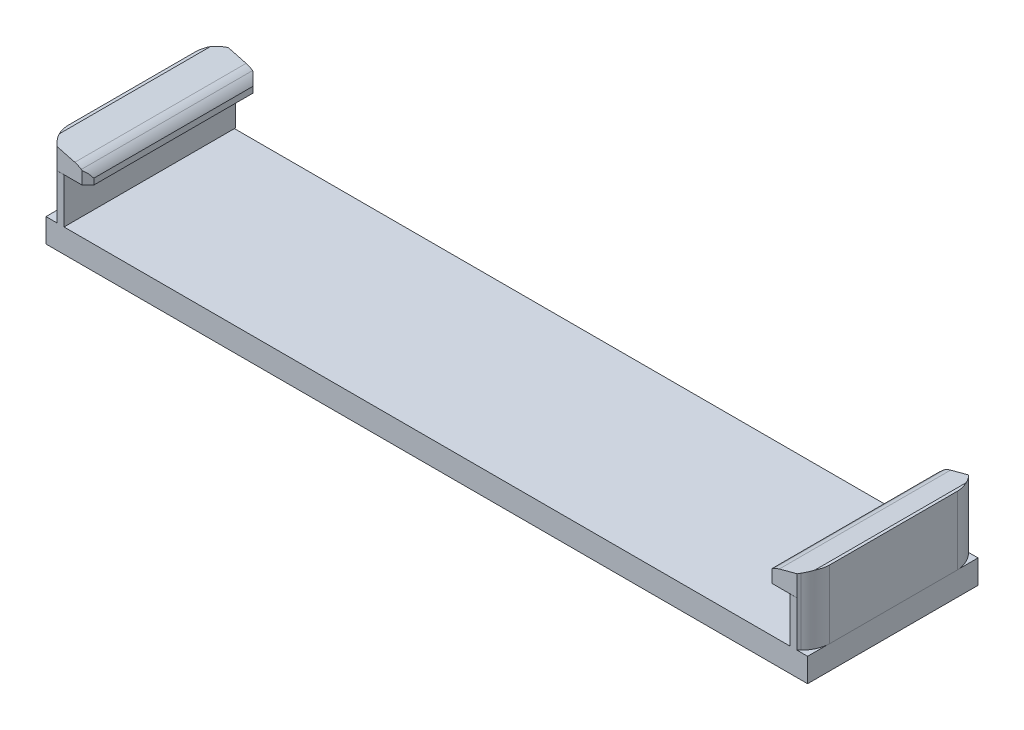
ISO-10303-21;
HEADER;
FILE_DESCRIPTION(('STEP AP214'),'2;1');
FILE_NAME('part.step','',(''),(''),'','','');
FILE_SCHEMA(('AUTOMOTIVE_DESIGN { 1 0 10303 214 1 1 1 1 }'));
ENDSEC;
DATA;
#1=APPLICATION_CONTEXT('core data for automotive mechanical design processes');
#2=APPLICATION_PROTOCOL_DEFINITION('international standard','automotive_design',2000,#1);
#3=PRODUCT_CONTEXT('',#1,'mechanical');
#4=PRODUCT('Part','Part','',(#3));
#5=PRODUCT_RELATED_PRODUCT_CATEGORY('part','',(#4));
#6=PRODUCT_DEFINITION_FORMATION('','',#4);
#7=PRODUCT_DEFINITION_CONTEXT('part definition',#1,'design');
#8=PRODUCT_DEFINITION('design','',#6,#7);
#9=PRODUCT_DEFINITION_SHAPE('','',#8);
#10=(LENGTH_UNIT() NAMED_UNIT(*) SI_UNIT(.MILLI.,.METRE.));
#11=(NAMED_UNIT(*) PLANE_ANGLE_UNIT() SI_UNIT($,.RADIAN.));
#12=(NAMED_UNIT(*) SI_UNIT($,.STERADIAN.) SOLID_ANGLE_UNIT());
#13=UNCERTAINTY_MEASURE_WITH_UNIT(LENGTH_MEASURE(1.E-05),#10,'distance_accuracy_value','');
#14=(GEOMETRIC_REPRESENTATION_CONTEXT(3) GLOBAL_UNCERTAINTY_ASSIGNED_CONTEXT((#13)) GLOBAL_UNIT_ASSIGNED_CONTEXT((#10,
#11,#12)) REPRESENTATION_CONTEXT('',''));
#15=CARTESIAN_POINT('',(0.,0.,0.));
#16=DIRECTION('',(0.,0.,1.));
#17=DIRECTION('',(1.,0.,0.));
#18=AXIS2_PLACEMENT_3D('',#15,#16,#17);
#19=CARTESIAN_POINT('',(0.,3.,0.));
#20=DIRECTION('',(0.,1.,0.));
#21=DIRECTION('',(0.,0.,1.));
#22=AXIS2_PLACEMENT_3D('',#19,#20,#21);
#23=PLANE('',#22);
#24=DIRECTION('',(-1.,0.,0.));
#25=VECTOR('',#24,1.);
#26=CARTESIAN_POINT('',(-32.0153685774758,3.,14.3999997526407));
#27=LINE('',#26,#25);
#28=CARTESIAN_POINT('',(31.9846314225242,3.,14.3999997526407));
#29=VERTEX_POINT('',#28);
#30=CARTESIAN_POINT('',(31.0999993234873,3.,14.3999997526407));
#31=VERTEX_POINT('',#30);
#32=EDGE_CURVE('E311',#29,#31,#27,.T.);
#33=ORIENTED_EDGE('',*,*,#32,.F.);
#34=DIRECTION('',(0.,0.,-1.));
#35=VECTOR('',#34,1.);
#36=CARTESIAN_POINT('',(31.9846314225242,3.,14.3930832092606));
#37=LINE('',#36,#35);
#38=CARTESIAN_POINT('',(31.9846314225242,3.,12.7412524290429));
#39=VERTEX_POINT('',#38);
#40=EDGE_CURVE('E320',#29,#39,#37,.T.);
#41=ORIENTED_EDGE('',*,*,#40,.T.);
#42=CARTESIAN_POINT('',(29.4999903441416,3.,12.464459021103));
#43=DIRECTION('',(0.,1.,0.));
#44=DIRECTION('',(0.,0.,1.));
#45=AXIS2_PLACEMENT_3D('',#42,#43,#44);
#46=CIRCLE('',#45,2.500011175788);
#47=CARTESIAN_POINT('',(31.2677659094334,3.,14.2322331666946));
#48=VERTEX_POINT('',#47);
#49=EDGE_CURVE('E407',#48,#39,#46,.T.);
#50=ORIENTED_EDGE('',*,*,#49,.F.);
#51=DIRECTION('',(0.707106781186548,0.,-0.707106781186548));
#52=VECTOR('',#51,1.);
#53=CARTESIAN_POINT('',(31.2677659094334,3.,14.2322331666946));
#54=LINE('',#53,#52);
#55=EDGE_CURVE('E323',#31,#48,#54,.T.);
#56=ORIENTED_EDGE('',*,*,#55,.F.);
#57=EDGE_LOOP('',(#33,#41,#50,#56));
#58=FACE_BOUND('',#57,.T.);
#59=ADVANCED_FACE('F49',(#58),#23,.T.);
#60=CARTESIAN_POINT('',(30.5000003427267,3.,14.3999997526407));
#61=VERTEX_POINT('',#60);
#62=CARTESIAN_POINT('',(-30.5000003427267,3.,14.3999997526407));
#63=VERTEX_POINT('',#62);
#64=EDGE_CURVE('E325',#61,#63,#27,.T.);
#65=ORIENTED_EDGE('',*,*,#64,.F.);
#66=DIRECTION('',(0.,0.,-1.));
#67=VECTOR('',#66,1.);
#68=CARTESIAN_POINT('',(30.5000003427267,3.,14.3999997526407));
#69=LINE('',#68,#67);
#70=CARTESIAN_POINT('',(30.5000003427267,3.,0.0802564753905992));
#71=VERTEX_POINT('',#70);
#72=EDGE_CURVE('E462',#61,#71,#69,.T.);
#73=ORIENTED_EDGE('',*,*,#72,.T.);
#74=DIRECTION('',(1.,0.,0.));
#75=VECTOR('',#74,1.);
#76=CARTESIAN_POINT('',(-36.6438552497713,3.,0.0802564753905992));
#77=LINE('',#76,#75);
#78=CARTESIAN_POINT('',(-30.5000003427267,3.,0.0802564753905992));
#79=VERTEX_POINT('',#78);
#80=EDGE_CURVE('E648',#79,#71,#77,.T.);
#81=ORIENTED_EDGE('',*,*,#80,.F.);
#82=DIRECTION('',(0.,0.,-1.));
#83=VECTOR('',#82,1.);
#84=CARTESIAN_POINT('',(-30.5000003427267,3.,14.3999997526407));
#85=LINE('',#84,#83);
#86=EDGE_CURVE('E335',#63,#79,#85,.T.);
#87=ORIENTED_EDGE('',*,*,#86,.F.);
#88=EDGE_LOOP('',(#65,#73,#81,#87));
#89=FACE_BOUND('',#88,.T.);
#90=ADVANCED_FACE('F646',(#89),#23,.T.);
#91=CARTESIAN_POINT('',(-31.0999993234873,3.,14.3999997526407));
#92=VERTEX_POINT('',#91);
#93=CARTESIAN_POINT('',(-32.0153685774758,3.,14.3999997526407));
#94=VERTEX_POINT('',#93);
#95=EDGE_CURVE('E327',#92,#94,#27,.T.);
#96=ORIENTED_EDGE('',*,*,#95,.F.);
#97=DIRECTION('',(-0.707106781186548,0.,-0.707106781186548));
#98=VECTOR('',#97,1.);
#99=CARTESIAN_POINT('',(-31.2677659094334,3.,14.2322331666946));
#100=LINE('',#99,#98);
#101=CARTESIAN_POINT('',(-31.2677659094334,3.,14.2322331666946));
#102=VERTEX_POINT('',#101);
#103=EDGE_CURVE('E517',#92,#102,#100,.T.);
#104=ORIENTED_EDGE('',*,*,#103,.T.);
#105=CARTESIAN_POINT('',(-29.4999903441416,3.,12.464459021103));
#106=DIRECTION('',(0.,-1.,0.));
#107=DIRECTION('',(0.,0.,1.));
#108=AXIS2_PLACEMENT_3D('',#105,#106,#107);
#109=CIRCLE('',#108,2.500011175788);
#110=CARTESIAN_POINT('',(-31.9968168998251,3.,12.5906058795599));
#111=VERTEX_POINT('',#110);
#112=EDGE_CURVE('E508',#102,#111,#109,.T.);
#113=ORIENTED_EDGE('',*,*,#112,.T.);
#114=DIRECTION('',(0.,0.,1.));
#115=VECTOR('',#114,1.);
#116=CARTESIAN_POINT('',(-31.9968168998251,3.,14.3999997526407));
#117=LINE('',#116,#115);
#118=CARTESIAN_POINT('',(-31.9968168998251,3.,1.80938703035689));
#119=VERTEX_POINT('',#118);
#120=EDGE_CURVE('E577',#119,#111,#117,.T.);
#121=ORIENTED_EDGE('',*,*,#120,.F.);
#122=CARTESIAN_POINT('',(-29.5000088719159,3.,1.93553342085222));
#123=DIRECTION('',(0.,-1.,0.));
#124=DIRECTION('',(0.,0.,-1.));
#125=AXIS2_PLACEMENT_3D('',#122,#123,#124);
#126=CIRCLE('',#125,2.4999926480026);
#127=CARTESIAN_POINT('',(-31.2677659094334,3.,0.167766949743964));
#128=VERTEX_POINT('',#127);
#129=EDGE_CURVE('E512',#119,#128,#126,.T.);
#130=ORIENTED_EDGE('',*,*,#129,.T.);
#131=DIRECTION('',(0.707106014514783,0.,-0.707107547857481));
#132=VECTOR('',#131,1.);
#133=CARTESIAN_POINT('',(-31.2677659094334,3.,0.167766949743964));
#134=LINE('',#133,#132);
#135=CARTESIAN_POINT('',(-31.180255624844,3.,0.0802564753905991));
#136=VERTEX_POINT('',#135);
#137=EDGE_CURVE('E526',#128,#136,#134,.T.);
#138=ORIENTED_EDGE('',*,*,#137,.T.);
#139=CARTESIAN_POINT('',(-32.0153685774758,3.,0.0802564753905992));
#140=VERTEX_POINT('',#139);
#141=EDGE_CURVE('E655',#140,#136,#77,.T.);
#142=ORIENTED_EDGE('',*,*,#141,.F.);
#143=DIRECTION('',(0.,0.,1.));
#144=VECTOR('',#143,1.);
#145=CARTESIAN_POINT('',(-32.0153685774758,3.,14.3930832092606));
#146=LINE('',#145,#144);
#147=EDGE_CURVE('E332',#140,#94,#146,.T.);
#148=ORIENTED_EDGE('',*,*,#147,.T.);
#149=EDGE_LOOP('',(#96,#104,#113,#121,#130,#138,#142,#148));
#150=FACE_BOUND('',#149,.T.);
#151=ADVANCED_FACE('F671',(#150),#23,.T.);
#152=CARTESIAN_POINT('',(31.9846314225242,3.,0.));
#153=DIRECTION('',(0.,0.,1.));
#154=DIRECTION('',(1.,0.,0.));
#155=AXIS2_PLACEMENT_3D('',#152,#153,#154);
#156=PLANE('',#155);
#157=DIRECTION('',(0.,-1.,0.));
#158=VECTOR('',#157,1.);
#159=CARTESIAN_POINT('',(31.0999993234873,8.73215006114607,0.));
#160=LINE('',#159,#158);
#161=CARTESIAN_POINT('',(31.0999993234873,8.55883867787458,0.));
#162=VERTEX_POINT('',#161);
#163=CARTESIAN_POINT('',(31.0999993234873,3.,0.));
#164=VERTEX_POINT('',#163);
#165=EDGE_CURVE('E421',#162,#164,#160,.T.);
#166=ORIENTED_EDGE('',*,*,#165,.T.);
#167=DIRECTION('',(-1.,0.,0.));
#168=VECTOR('',#167,1.);
#169=CARTESIAN_POINT('',(31.9846314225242,3.,0.));
#170=LINE('',#169,#168);
#171=CARTESIAN_POINT('',(30.5000003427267,3.,0.));
#172=VERTEX_POINT('',#171);
#173=EDGE_CURVE('E389',#164,#172,#170,.T.);
#174=ORIENTED_EDGE('',*,*,#173,.T.);
#175=DIRECTION('',(0.,-1.,0.));
#176=VECTOR('',#175,1.);
#177=CARTESIAN_POINT('',(30.5000003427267,6.8,0.));
#178=LINE('',#177,#176);
#179=CARTESIAN_POINT('',(30.5000003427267,6.80000009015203,0.));
#180=VERTEX_POINT('',#179);
#181=EDGE_CURVE('E497',#180,#172,#178,.T.);
#182=ORIENTED_EDGE('',*,*,#181,.F.);
#183=DIRECTION('',(1.,0.,0.));
#184=VECTOR('',#183,1.);
#185=CARTESIAN_POINT('',(31.7468168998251,6.80000009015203,0.));
#186=LINE('',#185,#184);
#187=CARTESIAN_POINT('',(28.999999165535,6.80000009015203,0.));
#188=VERTEX_POINT('',#187);
#189=EDGE_CURVE('E452',#188,#180,#186,.T.);
#190=ORIENTED_EDGE('',*,*,#189,.F.);
#191=DIRECTION('',(0.,-1.,0.));
#192=VECTOR('',#191,1.);
#193=CARTESIAN_POINT('',(28.999999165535,8.73215006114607,0.));
#194=LINE('',#193,#192);
#195=CARTESIAN_POINT('',(28.999999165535,7.86790985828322,0.));
#196=VERTEX_POINT('',#195);
#197=EDGE_CURVE('E399',#196,#188,#194,.T.);
#198=ORIENTED_EDGE('',*,*,#197,.F.);
#199=CARTESIAN_POINT('',(30.0633864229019,6.42762273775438,0.));
#200=DIRECTION('',(0.,0.,1.));
#201=DIRECTION('',(-1.,0.,0.));
#202=AXIS2_PLACEMENT_3D('',#199,#200,#201);
#203=CIRCLE('',#202,1.79031266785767);
#204=CARTESIAN_POINT('',(29.0544796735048,7.9065840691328,0.));
#205=VERTEX_POINT('',#204);
#206=EDGE_CURVE('E464',#205,#196,#203,.T.);
#207=ORIENTED_EDGE('',*,*,#206,.F.);
#208=CARTESIAN_POINT('',(30.0633373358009,6.42769469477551,0.));
#209=DIRECTION('',(0.,0.,1.));
#210=DIRECTION('',(-1.,0.,0.));
#211=AXIS2_PLACEMENT_3D('',#208,#209,#210);
#212=CIRCLE('',#211,1.79022556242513);
#213=CARTESIAN_POINT('',(29.6000000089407,8.1569217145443,0.));
#214=VERTEX_POINT('',#213);
#215=EDGE_CURVE('E467',#214,#205,#212,.T.);
#216=ORIENTED_EDGE('',*,*,#215,.F.);
#217=DIRECTION('',(-0.965926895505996,-0.258815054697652,0.));
#218=VECTOR('',#217,1.);
#219=CARTESIAN_POINT('',(29.6000000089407,8.1569217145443,0.));
#220=LINE('',#219,#218);
#221=EDGE_CURVE('E470',#162,#214,#220,.T.);
#222=ORIENTED_EDGE('',*,*,#221,.F.);
#223=EDGE_LOOP('',(#166,#174,#182,#190,#198,#207,#216,#222));
#224=FACE_BOUND('',#223,.T.);
#225=ADVANCED_FACE('F733',(#224),#156,.F.);
#226=CARTESIAN_POINT('',(0.,3.,0.));
#227=DIRECTION('',(0.,1.,0.));
#228=DIRECTION('',(0.,0.,1.));
#229=AXIS2_PLACEMENT_3D('',#226,#227,#228);
#230=PLANE('',#229);
#231=DIRECTION('',(0.,0.,1.));
#232=VECTOR('',#231,1.);
#233=CARTESIAN_POINT('',(31.9968168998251,3.,14.3999997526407));
#234=LINE('',#233,#232);
#235=CARTESIAN_POINT('',(31.9968168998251,3.,1.80938703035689));
#236=VERTEX_POINT('',#235);
#237=CARTESIAN_POINT('',(31.9968168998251,3.,12.5906058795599));
#238=VERTEX_POINT('',#237);
#239=EDGE_CURVE('E500',#236,#238,#234,.T.);
#240=ORIENTED_EDGE('',*,*,#239,.T.);
#241=EDGE_CURVE('E409',#39,#238,#46,.T.);
#242=ORIENTED_EDGE('',*,*,#241,.F.);
#243=CARTESIAN_POINT('',(31.9846314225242,3.,1.65874104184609));
#244=VERTEX_POINT('',#243);
#245=EDGE_CURVE('E331',#39,#244,#37,.T.);
#246=ORIENTED_EDGE('',*,*,#245,.T.);
#247=CARTESIAN_POINT('',(29.5000088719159,3.,1.93553342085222));
#248=DIRECTION('',(0.,1.,0.));
#249=DIRECTION('',(0.,0.,-1.));
#250=AXIS2_PLACEMENT_3D('',#247,#248,#249);
#251=CIRCLE('',#250,2.4999926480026);
#252=EDGE_CURVE('E415',#236,#244,#251,.T.);
#253=ORIENTED_EDGE('',*,*,#252,.F.);
#254=EDGE_LOOP('',(#240,#242,#246,#253));
#255=FACE_BOUND('',#254,.T.);
#256=ADVANCED_FACE('F737',(#255),#230,.F.);
#257=CARTESIAN_POINT('',(0.,6.8,0.));
#258=DIRECTION('',(0.,1.,0.));
#259=DIRECTION('',(0.,0.,1.));
#260=AXIS2_PLACEMENT_3D('',#257,#258,#259);
#261=PLANE('',#260);
#262=DIRECTION('',(-0.707106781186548,0.,0.707106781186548));
#263=VECTOR('',#262,1.);
#264=CARTESIAN_POINT('',(22.749999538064,6.8,22.749999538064));
#265=LINE('',#264,#263);
#266=CARTESIAN_POINT('',(31.1069158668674,6.80000009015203,14.3930832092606));
#267=VERTEX_POINT('',#266);
#268=CARTESIAN_POINT('',(31.0999993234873,6.8,14.3999997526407));
#269=VERTEX_POINT('',#268);
#270=EDGE_CURVE('E436',#267,#269,#265,.T.);
#271=ORIENTED_EDGE('',*,*,#270,.F.);
#272=DIRECTION('',(-1.,0.,0.));
#273=VECTOR('',#272,1.);
#274=CARTESIAN_POINT('',(31.7468168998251,6.80000009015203,14.3930832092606));
#275=LINE('',#274,#273);
#276=CARTESIAN_POINT('',(30.5000003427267,6.8,14.3930832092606));
#277=VERTEX_POINT('',#276);
#278=EDGE_CURVE('E456',#267,#277,#275,.T.);
#279=ORIENTED_EDGE('',*,*,#278,.T.);
#280=DIRECTION('',(0.,0.,-1.));
#281=VECTOR('',#280,1.);
#282=CARTESIAN_POINT('',(30.5000003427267,6.8,14.3999997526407));
#283=LINE('',#282,#281);
#284=CARTESIAN_POINT('',(30.5000003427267,6.8,14.3999997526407));
#285=VERTEX_POINT('',#284);
#286=EDGE_CURVE('E491',#285,#277,#283,.T.);
#287=ORIENTED_EDGE('',*,*,#286,.F.);
#288=DIRECTION('',(-1.,0.,0.));
#289=VECTOR('',#288,1.);
#290=CARTESIAN_POINT('',(30.5000003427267,6.8,14.3999997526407));
#291=LINE('',#290,#289);
#292=EDGE_CURVE('E494',#269,#285,#291,.T.);
#293=ORIENTED_EDGE('',*,*,#292,.F.);
#294=EDGE_LOOP('',(#271,#279,#287,#293));
#295=FACE_BOUND('',#294,.T.);
#296=ADVANCED_FACE('F743',(#295),#261,.T.);
#297=DIRECTION('',(0.,-1.,0.));
#298=VECTOR('',#297,1.);
#299=CARTESIAN_POINT('',(-30.5000003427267,6.8,0.));
#300=LINE('',#299,#298);
#301=CARTESIAN_POINT('',(-30.5000003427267,6.8,0.));
#302=VERTEX_POINT('',#301);
#303=CARTESIAN_POINT('',(-30.5000003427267,3.,0.));
#304=VERTEX_POINT('',#303);
#305=EDGE_CURVE('E339',#302,#304,#300,.T.);
#306=ORIENTED_EDGE('',*,*,#305,.T.);
#307=CARTESIAN_POINT('',(-31.0999993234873,3.,0.));
#308=VERTEX_POINT('',#307);
#309=EDGE_CURVE('E398',#304,#308,#170,.T.);
#310=ORIENTED_EDGE('',*,*,#309,.T.);
#311=DIRECTION('',(0.,-1.,0.));
#312=VECTOR('',#311,1.);
#313=CARTESIAN_POINT('',(-31.0999993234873,8.73215006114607,0.));
#314=LINE('',#313,#312);
#315=CARTESIAN_POINT('',(-31.0999993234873,8.55883867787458,0.));
#316=VERTEX_POINT('',#315);
#317=EDGE_CURVE('E529',#316,#308,#314,.T.);
#318=ORIENTED_EDGE('',*,*,#317,.F.);
#319=DIRECTION('',(0.965926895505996,-0.258815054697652,0.));
#320=VECTOR('',#319,1.);
#321=CARTESIAN_POINT('',(-29.6000000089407,8.1569217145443,0.));
#322=LINE('',#321,#320);
#323=CARTESIAN_POINT('',(-29.6000000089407,8.1569217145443,0.));
#324=VERTEX_POINT('',#323);
#325=EDGE_CURVE('E565',#316,#324,#322,.T.);
#326=ORIENTED_EDGE('',*,*,#325,.T.);
#327=CARTESIAN_POINT('',(-30.0633373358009,6.42769469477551,0.));
#328=DIRECTION('',(0.,0.,-1.));
#329=DIRECTION('',(1.,0.,0.));
#330=AXIS2_PLACEMENT_3D('',#327,#328,#329);
#331=CIRCLE('',#330,1.79022556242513);
#332=CARTESIAN_POINT('',(-29.0544796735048,7.9065840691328,0.));
#333=VERTEX_POINT('',#332);
#334=EDGE_CURVE('E579',#324,#333,#331,.T.);
#335=ORIENTED_EDGE('',*,*,#334,.T.);
#336=CARTESIAN_POINT('',(-30.0633864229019,6.42762273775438,0.));
#337=DIRECTION('',(0.,0.,-1.));
#338=DIRECTION('',(1.,0.,0.));
#339=AXIS2_PLACEMENT_3D('',#336,#337,#338);
#340=CIRCLE('',#339,1.79031266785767);
#341=CARTESIAN_POINT('',(-28.999999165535,7.86790985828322,0.));
#342=VERTEX_POINT('',#341);
#343=EDGE_CURVE('E582',#333,#342,#340,.T.);
#344=ORIENTED_EDGE('',*,*,#343,.T.);
#345=DIRECTION('',(0.,-1.,0.));
#346=VECTOR('',#345,1.);
#347=CARTESIAN_POINT('',(-28.999999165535,8.73215006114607,0.));
#348=LINE('',#347,#346);
#349=CARTESIAN_POINT('',(-28.999999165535,6.80000009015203,0.));
#350=VERTEX_POINT('',#349);
#351=EDGE_CURVE('E509',#342,#350,#348,.T.);
#352=ORIENTED_EDGE('',*,*,#351,.T.);
#353=DIRECTION('',(-1.,0.,0.));
#354=VECTOR('',#353,1.);
#355=CARTESIAN_POINT('',(-31.7468168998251,6.80000009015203,0.));
#356=LINE('',#355,#354);
#357=EDGE_CURVE('E585',#350,#302,#356,.T.);
#358=ORIENTED_EDGE('',*,*,#357,.T.);
#359=EDGE_LOOP('',(#306,#310,#318,#326,#335,#344,#352,#358));
#360=FACE_BOUND('',#359,.T.);
#361=ADVANCED_FACE('F621',(#360),#156,.F.);
#362=CARTESIAN_POINT('',(-31.9968168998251,6.8,14.3999997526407));
#363=DIRECTION('',(1.,0.,0.));
#364=DIRECTION('',(0.,0.,-1.));
#365=AXIS2_PLACEMENT_3D('',#362,#363,#364);
#366=PLANE('',#365);
#367=DIRECTION('',(0.,-1.,0.));
#368=VECTOR('',#367,1.);
#369=CARTESIAN_POINT('',(-31.9968168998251,8.73215006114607,12.5906058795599));
#370=LINE('',#369,#368);
#371=CARTESIAN_POINT('',(-31.9968168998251,8.73215006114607,12.5906058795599));
#372=VERTEX_POINT('',#371);
#373=EDGE_CURVE('E557',#372,#111,#370,.T.);
#374=ORIENTED_EDGE('',*,*,#373,.F.);
#375=DIRECTION('',(0.,0.,-1.));
#376=VECTOR('',#375,1.);
#377=CARTESIAN_POINT('',(-31.9968168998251,8.73215006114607,18.3881967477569));
#378=LINE('',#377,#376);
#379=CARTESIAN_POINT('',(-31.9968168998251,8.73215006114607,1.80938703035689));
#380=VERTEX_POINT('',#379);
#381=EDGE_CURVE('E587',#372,#380,#378,.T.);
#382=ORIENTED_EDGE('',*,*,#381,.T.);
#383=DIRECTION('',(0.,-1.,0.));
#384=VECTOR('',#383,1.);
#385=CARTESIAN_POINT('',(-31.9968168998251,8.73215006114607,1.80938703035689));
#386=LINE('',#385,#384);
#387=EDGE_CURVE('E552',#119,#380,#386,.F.);
#388=ORIENTED_EDGE('',*,*,#387,.F.);
#389=ORIENTED_EDGE('',*,*,#120,.T.);
#390=EDGE_LOOP('',(#374,#382,#388,#389));
#391=FACE_BOUND('',#390,.T.);
#392=ADVANCED_FACE('F678',(#391),#366,.F.);
#393=CARTESIAN_POINT('',(-30.5000003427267,6.8,14.3999997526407));
#394=DIRECTION('',(0.,0.,-1.));
#395=DIRECTION('',(-1.,0.,0.));
#396=AXIS2_PLACEMENT_3D('',#393,#394,#395);
#397=PLANE('',#396);
#398=DIRECTION('',(0.,-1.,0.));
#399=VECTOR('',#398,1.);
#400=CARTESIAN_POINT('',(-31.0999993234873,8.73215006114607,14.3999997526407));
#401=LINE('',#400,#399);
#402=CARTESIAN_POINT('',(-31.0999993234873,6.8,14.3999997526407));
#403=VERTEX_POINT('',#402);
#404=EDGE_CURVE('E513',#403,#92,#401,.T.);
#405=ORIENTED_EDGE('',*,*,#404,.T.);
#406=ORIENTED_EDGE('',*,*,#95,.T.);
#407=DIRECTION('',(0.,1.,0.));
#408=VECTOR('',#407,1.);
#409=CARTESIAN_POINT('',(-32.0153685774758,-7.,14.3999997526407));
#410=LINE('',#409,#408);
#411=CARTESIAN_POINT('',(-32.0153685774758,1.,14.3999997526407));
#412=VERTEX_POINT('',#411);
#413=EDGE_CURVE('E316',#412,#94,#410,.T.);
#414=ORIENTED_EDGE('',*,*,#413,.F.);
#415=DIRECTION('',(-1.,0.,0.));
#416=VECTOR('',#415,1.);
#417=CARTESIAN_POINT('',(0.,1.,14.3999997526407));
#418=LINE('',#417,#416);
#419=CARTESIAN_POINT('',(31.9846314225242,1.,14.3999997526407));
#420=VERTEX_POINT('',#419);
#421=EDGE_CURVE('E13',#420,#412,#418,.T.);
#422=ORIENTED_EDGE('',*,*,#421,.F.);
#423=DIRECTION('',(0.,1.,0.));
#424=VECTOR('',#423,1.);
#425=CARTESIAN_POINT('',(31.9846314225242,-7.,14.3999997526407));
#426=LINE('',#425,#424);
#427=EDGE_CURVE('E306',#420,#29,#426,.T.);
#428=ORIENTED_EDGE('',*,*,#427,.T.);
#429=ORIENTED_EDGE('',*,*,#32,.T.);
#430=DIRECTION('',(0.,-1.,0.));
#431=VECTOR('',#430,1.);
#432=CARTESIAN_POINT('',(31.0999993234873,8.73215006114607,14.3999997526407));
#433=LINE('',#432,#431);
#434=EDGE_CURVE('E406',#269,#31,#433,.T.);
#435=ORIENTED_EDGE('',*,*,#434,.F.);
#436=ORIENTED_EDGE('',*,*,#292,.T.);
#437=DIRECTION('',(0.,-1.,0.));
#438=VECTOR('',#437,1.);
#439=CARTESIAN_POINT('',(30.5000003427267,6.8,14.3999997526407));
#440=LINE('',#439,#438);
#441=EDGE_CURVE('E505',#285,#61,#440,.T.);
#442=ORIENTED_EDGE('',*,*,#441,.T.);
#443=ORIENTED_EDGE('',*,*,#64,.T.);
#444=DIRECTION('',(0.,-1.,0.));
#445=VECTOR('',#444,1.);
#446=CARTESIAN_POINT('',(-30.5000003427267,6.8,14.3999997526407));
#447=LINE('',#446,#445);
#448=CARTESIAN_POINT('',(-30.5000003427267,6.8,14.3999997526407));
#449=VERTEX_POINT('',#448);
#450=EDGE_CURVE('E609',#449,#63,#447,.T.);
#451=ORIENTED_EDGE('',*,*,#450,.F.);
#452=DIRECTION('',(1.,0.,0.));
#453=VECTOR('',#452,1.);
#454=CARTESIAN_POINT('',(-30.5000003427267,6.8,14.3999997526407));
#455=LINE('',#454,#453);
#456=EDGE_CURVE('E606',#403,#449,#455,.T.);
#457=ORIENTED_EDGE('',*,*,#456,.F.);
#458=EDGE_LOOP('',(#405,#406,#414,#422,#428,#429,#435,#436,#442,#443,#451,#457));
#459=FACE_BOUND('',#458,.T.);
#460=ADVANCED_FACE('F309',(#459),#397,.F.);
#461=CARTESIAN_POINT('',(0.,6.8,0.));
#462=DIRECTION('',(0.,1.,0.));
#463=DIRECTION('',(0.,0.,1.));
#464=AXIS2_PLACEMENT_3D('',#461,#462,#463);
#465=PLANE('',#464);
#466=DIRECTION('',(1.,0.,0.));
#467=VECTOR('',#466,1.);
#468=CARTESIAN_POINT('',(-31.7468168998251,6.80000009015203,14.3930832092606));
#469=LINE('',#468,#467);
#470=CARTESIAN_POINT('',(-31.1069158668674,6.80000009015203,14.3930832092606));
#471=VERTEX_POINT('',#470);
#472=CARTESIAN_POINT('',(-30.5000003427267,6.80000009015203,14.3930832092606));
#473=VERTEX_POINT('',#472);
#474=EDGE_CURVE('E575',#471,#473,#469,.T.);
#475=ORIENTED_EDGE('',*,*,#474,.F.);
#476=DIRECTION('',(0.707106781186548,0.,0.707106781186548));
#477=VECTOR('',#476,1.);
#478=CARTESIAN_POINT('',(-22.749999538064,6.8,22.749999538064));
#479=LINE('',#478,#477);
#480=EDGE_CURVE('E546',#471,#403,#479,.T.);
#481=ORIENTED_EDGE('',*,*,#480,.T.);
#482=ORIENTED_EDGE('',*,*,#456,.T.);
#483=DIRECTION('',(0.,0.,-1.));
#484=VECTOR('',#483,1.);
#485=CARTESIAN_POINT('',(-30.5000003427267,6.8,14.3999997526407));
#486=LINE('',#485,#484);
#487=EDGE_CURVE('E603',#449,#473,#486,.T.);
#488=ORIENTED_EDGE('',*,*,#487,.T.);
#489=EDGE_LOOP('',(#475,#481,#482,#488));
#490=FACE_BOUND('',#489,.T.);
#491=ADVANCED_FACE('F639',(#490),#465,.T.);
#492=CARTESIAN_POINT('',(-31.7468168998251,6.80000009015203,18.3881967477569));
#493=DIRECTION('',(0.,-1.,0.));
#494=DIRECTION('',(0.,0.,-1.));
#495=AXIS2_PLACEMENT_3D('',#492,#493,#494);
#496=PLANE('',#495);
#497=ORIENTED_EDGE('',*,*,#357,.F.);
#498=DIRECTION('',(0.707106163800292,0.,0.707107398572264));
#499=VECTOR('',#498,1.);
#500=CARTESIAN_POINT('',(-21.1793072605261,6.80000009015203,7.82070556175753));
#501=LINE('',#500,#499);
#502=CARTESIAN_POINT('',(-28.5000000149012,6.80000009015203,0.500000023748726));
#503=VERTEX_POINT('',#502);
#504=EDGE_CURVE('E562',#350,#503,#501,.T.);
#505=ORIENTED_EDGE('',*,*,#504,.T.);
#506=DIRECTION('',(0.,0.,-1.));
#507=VECTOR('',#506,1.);
#508=CARTESIAN_POINT('',(-28.5000000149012,6.80000009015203,18.3881967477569));
#509=LINE('',#508,#507);
#510=CARTESIAN_POINT('',(-28.5000000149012,6.80000009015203,13.9000006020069));
#511=VERTEX_POINT('',#510);
#512=EDGE_CURVE('E570',#511,#503,#509,.T.);
#513=ORIENTED_EDGE('',*,*,#512,.F.);
#514=DIRECTION('',(-0.707106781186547,0.,0.707106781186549));
#515=VECTOR('',#514,1.);
#516=CARTESIAN_POINT('',(-32.3675065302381,6.80000009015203,17.7675071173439));
#517=LINE('',#516,#515);
#518=CARTESIAN_POINT('',(-28.9930826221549,6.8,14.3930832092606));
#519=VERTEX_POINT('',#518);
#520=EDGE_CURVE('E540',#511,#519,#517,.T.);
#521=ORIENTED_EDGE('',*,*,#520,.T.);
#522=EDGE_CURVE('E574',#473,#519,#469,.T.);
#523=ORIENTED_EDGE('',*,*,#522,.F.);
#524=EDGE_CURVE('E607',#473,#302,#486,.T.);
#525=ORIENTED_EDGE('',*,*,#524,.T.);
#526=EDGE_LOOP('',(#497,#505,#513,#521,#523,#525));
#527=FACE_BOUND('',#526,.T.);
#528=ADVANCED_FACE('F629',(#527),#496,.T.);
#529=CARTESIAN_POINT('',(-28.5000000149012,6.80000009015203,18.3881967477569));
#530=DIRECTION('',(1.,0.,0.));
#531=DIRECTION('',(0.,0.,-1.));
#532=AXIS2_PLACEMENT_3D('',#529,#530,#531);
#533=PLANE('',#532);
#534=ORIENTED_EDGE('',*,*,#512,.T.);
#535=DIRECTION('',(0.,1.,0.));
#536=VECTOR('',#535,1.);
#537=CARTESIAN_POINT('',(-28.5000000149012,6.80000009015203,0.500000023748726));
#538=LINE('',#537,#536);
#539=CARTESIAN_POINT('',(-28.5000000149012,7.30000017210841,0.500000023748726));
#540=VERTEX_POINT('',#539);
#541=EDGE_CURVE('E559',#503,#540,#538,.T.);
#542=ORIENTED_EDGE('',*,*,#541,.T.);
#543=DIRECTION('',(0.,0.,-1.));
#544=VECTOR('',#543,1.);
#545=CARTESIAN_POINT('',(-28.5000000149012,7.30000017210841,18.3881967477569));
#546=LINE('',#545,#544);
#547=CARTESIAN_POINT('',(-28.5000000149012,7.30000017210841,13.9000006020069));
#548=VERTEX_POINT('',#547);
#549=EDGE_CURVE('E590',#548,#540,#546,.T.);
#550=ORIENTED_EDGE('',*,*,#549,.F.);
#551=DIRECTION('',(0.,-1.,0.));
#552=VECTOR('',#551,1.);
#553=CARTESIAN_POINT('',(-28.5000000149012,6.80000009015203,13.9000006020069));
#554=LINE('',#553,#552);
#555=EDGE_CURVE('E537',#548,#511,#554,.T.);
#556=ORIENTED_EDGE('',*,*,#555,.T.);
#557=EDGE_LOOP('',(#534,#542,#550,#556));
#558=FACE_BOUND('',#557,.T.);
#559=ADVANCED_FACE('F700',(#558),#533,.T.);
#560=CARTESIAN_POINT('',(-30.0633864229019,6.42762273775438,18.3881967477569));
#561=DIRECTION('',(0.,0.,-1.));
#562=DIRECTION('',(-1.,0.,0.));
#563=AXIS2_PLACEMENT_3D('',#560,#561,#562);
#564=CYLINDRICAL_SURFACE('',#563,1.79031266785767);
#565=ORIENTED_EDGE('',*,*,#549,.T.);
#566=CARTESIAN_POINT('',(-30.0633864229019,6.42762273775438,-1.06338911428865));
#567=DIRECTION('',(0.707107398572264,0.,-0.707106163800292));
#568=DIRECTION('',(-0.707106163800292,0.,-0.707107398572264));
#569=AXIS2_PLACEMENT_3D('',#566,#567,#568);
#570=ELLIPSE('',#569,2.53188666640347,1.79031266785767);
#571=EDGE_CURVE('E352',#540,#342,#570,.F.);
#572=ORIENTED_EDGE('',*,*,#571,.T.);
#573=ORIENTED_EDGE('',*,*,#343,.F.);
#574=DIRECTION('',(0.,0.,-1.));
#575=VECTOR('',#574,1.);
#576=CARTESIAN_POINT('',(-29.0544796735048,7.9065840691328,18.3881967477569));
#577=LINE('',#576,#575);
#578=CARTESIAN_POINT('',(-29.0544796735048,7.9065840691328,14.3930832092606));
#579=VERTEX_POINT('',#578);
#580=EDGE_CURVE('E593',#579,#333,#577,.T.);
#581=ORIENTED_EDGE('',*,*,#580,.F.);
#582=CARTESIAN_POINT('',(-30.0633864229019,6.42762273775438,14.3930832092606));
#583=DIRECTION('',(0.,0.,-1.));
#584=DIRECTION('',(-1.,0.,0.));
#585=AXIS2_PLACEMENT_3D('',#582,#583,#584);
#586=CIRCLE('',#585,1.79031266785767);
#587=CARTESIAN_POINT('',(-28.9930826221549,7.86277751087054,14.3930832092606));
#588=VERTEX_POINT('',#587);
#589=EDGE_CURVE('E572',#588,#579,#586,.F.);
#590=ORIENTED_EDGE('',*,*,#589,.F.);
#591=CARTESIAN_POINT('',(-30.0633864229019,6.42762273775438,15.4633870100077));
#592=DIRECTION('',(0.707106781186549,0.,0.707106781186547));
#593=DIRECTION('',(0.707106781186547,0.,-0.707106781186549));
#594=AXIS2_PLACEMENT_3D('',#591,#592,#593);
#595=ELLIPSE('',#594,2.53188445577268,1.79031266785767);
#596=EDGE_CURVE('E534',#588,#548,#595,.F.);
#597=ORIENTED_EDGE('',*,*,#596,.T.);
#598=EDGE_LOOP('',(#565,#572,#573,#581,#590,#597));
#599=FACE_BOUND('',#598,.T.);
#600=ADVANCED_FACE('F696',(#599),#564,.T.);
#601=CARTESIAN_POINT('',(-29.6000000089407,8.1569217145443,18.3881967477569));
#602=DIRECTION('',(0.258815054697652,0.965926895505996,0.));
#603=DIRECTION('',(-0.965926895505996,0.258815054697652,0.));
#604=AXIS2_PLACEMENT_3D('',#601,#602,#603);
#605=PLANE('',#604);
#606=DIRECTION('',(0.,0.,-1.));
#607=VECTOR('',#606,1.);
#608=CARTESIAN_POINT('',(-31.7468168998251,8.73215006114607,18.3881967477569));
#609=LINE('',#608,#607);
#610=CARTESIAN_POINT('',(-31.7468168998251,8.73215006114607,13.5607374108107));
#611=VERTEX_POINT('',#610);
#612=CARTESIAN_POINT('',(-31.7468168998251,8.73215006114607,0.839259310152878));
#613=VERTEX_POINT('',#612);
#614=EDGE_CURVE('E598',#611,#613,#609,.T.);
#615=ORIENTED_EDGE('',*,*,#614,.F.);
#616=CARTESIAN_POINT('',(-29.4999903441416,8.13012464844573,12.464459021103));
#617=DIRECTION('',(0.258815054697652,0.965926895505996,0.));
#618=DIRECTION('',(0.965926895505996,-0.258815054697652,0.));
#619=AXIS2_PLACEMENT_3D('',#616,#617,#618);
#620=ELLIPSE('',#619,2.58819915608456,2.500011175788);
#621=CARTESIAN_POINT('',(-31.2677659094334,8.60379085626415,14.2322331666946));
#622=VERTEX_POINT('',#621);
#623=EDGE_CURVE('E554',#611,#622,#620,.T.);
#624=ORIENTED_EDGE('',*,*,#623,.T.);
#625=DIRECTION('',(0.694746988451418,-0.186153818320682,0.694746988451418));
#626=VECTOR('',#625,1.);
#627=CARTESIAN_POINT('',(-28.3990132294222,7.83512359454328,17.1009858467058));
#628=LINE('',#627,#626);
#629=CARTESIAN_POINT('',(-31.1069158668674,8.56069192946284,14.3930832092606));
#630=VERTEX_POINT('',#629);
#631=EDGE_CURVE('E543',#622,#630,#628,.T.);
#632=ORIENTED_EDGE('',*,*,#631,.T.);
#633=DIRECTION('',(-0.965926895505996,0.258815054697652,0.));
#634=VECTOR('',#633,1.);
#635=CARTESIAN_POINT('',(-29.6000000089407,8.1569217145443,14.3930832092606));
#636=LINE('',#635,#634);
#637=CARTESIAN_POINT('',(-29.6000000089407,8.1569217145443,14.3930832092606));
#638=VERTEX_POINT('',#637);
#639=EDGE_CURVE('E566',#638,#630,#636,.T.);
#640=ORIENTED_EDGE('',*,*,#639,.F.);
#641=DIRECTION('',(0.,0.,-1.));
#642=VECTOR('',#641,1.);
#643=CARTESIAN_POINT('',(-29.6000000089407,8.1569217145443,18.3881967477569));
#644=LINE('',#643,#642);
#645=EDGE_CURVE('E595',#638,#324,#644,.T.);
#646=ORIENTED_EDGE('',*,*,#645,.T.);
#647=ORIENTED_EDGE('',*,*,#325,.F.);
#648=DIRECTION('',(-0.694746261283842,0.186153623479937,0.694747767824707));
#649=VECTOR('',#648,1.);
#650=CARTESIAN_POINT('',(-39.1995050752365,10.7290588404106,8.09952331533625));
#651=LINE('',#650,#649);
#652=CARTESIAN_POINT('',(-31.2677659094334,8.60379085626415,0.167766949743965));
#653=VERTEX_POINT('',#652);
#654=EDGE_CURVE('E349',#316,#653,#651,.T.);
#655=ORIENTED_EDGE('',*,*,#654,.T.);
#656=CARTESIAN_POINT('',(-29.5000088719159,8.13012961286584,1.93553342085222));
#657=DIRECTION('',(0.258815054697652,0.965926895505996,0.));
#658=DIRECTION('',(0.965926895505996,-0.258815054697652,0.));
#659=AXIS2_PLACEMENT_3D('',#656,#657,#658);
#660=ELLIPSE('',#659,2.5881799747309,2.4999926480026);
#661=EDGE_CURVE('E549',#653,#613,#660,.T.);
#662=ORIENTED_EDGE('',*,*,#661,.T.);
#663=EDGE_LOOP('',(#615,#624,#632,#640,#646,#647,#655,#662));
#664=FACE_BOUND('',#663,.T.);
#665=ADVANCED_FACE('F685',(#664),#605,.T.);
#666=CARTESIAN_POINT('',(-31.9968168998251,8.73215006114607,18.3881967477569));
#667=DIRECTION('',(0.,1.,0.));
#668=DIRECTION('',(0.,0.,1.));
#669=AXIS2_PLACEMENT_3D('',#666,#667,#668);
#670=PLANE('',#669);
#671=ORIENTED_EDGE('',*,*,#381,.F.);
#672=CARTESIAN_POINT('',(-29.4999903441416,8.73215006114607,12.464459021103));
#673=DIRECTION('',(0.,-1.,0.));
#674=DIRECTION('',(0.,0.,1.));
#675=AXIS2_PLACEMENT_3D('',#672,#673,#674);
#676=CIRCLE('',#675,2.500011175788);
#677=EDGE_CURVE('E514',#611,#372,#676,.T.);
#678=ORIENTED_EDGE('',*,*,#677,.F.);
#679=ORIENTED_EDGE('',*,*,#614,.T.);
#680=CARTESIAN_POINT('',(-29.5000088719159,8.73215006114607,1.93553342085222));
#681=DIRECTION('',(0.,1.,0.));
#682=DIRECTION('',(0.,0.,1.));
#683=AXIS2_PLACEMENT_3D('',#680,#681,#682);
#684=CIRCLE('',#683,2.4999926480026);
#685=EDGE_CURVE('E346',#613,#380,#684,.T.);
#686=ORIENTED_EDGE('',*,*,#685,.T.);
#687=EDGE_LOOP('',(#671,#678,#679,#686));
#688=FACE_BOUND('',#687,.T.);
#689=ADVANCED_FACE('F682',(#688),#670,.T.);
#690=CARTESIAN_POINT('',(31.9846314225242,3.,14.3930832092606));
#691=DIRECTION('',(0.,0.,-1.));
#692=DIRECTION('',(-1.,0.,0.));
#693=AXIS2_PLACEMENT_3D('',#690,#691,#692);
#694=PLANE('',#693);
#695=DIRECTION('',(0.,1.,0.));
#696=VECTOR('',#695,1.);
#697=CARTESIAN_POINT('',(-31.1069158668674,3.,14.3930832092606));
#698=LINE('',#697,#696);
#699=EDGE_CURVE('E344',#471,#630,#698,.T.);
#700=ORIENTED_EDGE('',*,*,#699,.F.);
#701=ORIENTED_EDGE('',*,*,#474,.T.);
#702=ORIENTED_EDGE('',*,*,#522,.T.);
#703=DIRECTION('',(0.,-1.,0.));
#704=VECTOR('',#703,1.);
#705=CARTESIAN_POINT('',(-28.9930826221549,3.,14.3930832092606));
#706=LINE('',#705,#704);
#707=EDGE_CURVE('E342',#588,#519,#706,.T.);
#708=ORIENTED_EDGE('',*,*,#707,.F.);
#709=ORIENTED_EDGE('',*,*,#589,.T.);
#710=CARTESIAN_POINT('',(-30.0633373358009,6.42769469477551,14.3930832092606));
#711=DIRECTION('',(0.,0.,-1.));
#712=DIRECTION('',(-1.,0.,0.));
#713=AXIS2_PLACEMENT_3D('',#710,#711,#712);
#714=CIRCLE('',#713,1.79022556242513);
#715=EDGE_CURVE('E569',#579,#638,#714,.F.);
#716=ORIENTED_EDGE('',*,*,#715,.T.);
#717=ORIENTED_EDGE('',*,*,#639,.T.);
#718=EDGE_LOOP('',(#700,#701,#702,#708,#709,#716,#717));
#719=FACE_BOUND('',#718,.T.);
#720=ADVANCED_FACE('F635',(#719),#694,.F.);
#721=CARTESIAN_POINT('',(31.9846314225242,3.,14.3930832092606));
#722=DIRECTION('',(-1.,0.,0.));
#723=DIRECTION('',(0.,0.,1.));
#724=AXIS2_PLACEMENT_3D('',#721,#722,#723);
#725=PLANE('',#724);
#726=ORIENTED_EDGE('',*,*,#40,.F.);
#727=ORIENTED_EDGE('',*,*,#427,.F.);
#728=DIRECTION('',(0.,0.,-1.));
#729=VECTOR('',#728,1.);
#730=CARTESIAN_POINT('',(31.9846314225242,1.,14.3930832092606));
#731=LINE('',#730,#729);
#732=CARTESIAN_POINT('',(31.9846314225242,1.,0.0802564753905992));
#733=VERTEX_POINT('',#732);
#734=EDGE_CURVE('E368',#420,#733,#731,.T.);
#735=ORIENTED_EDGE('',*,*,#734,.T.);
#736=DIRECTION('',(0.,1.,0.));
#737=VECTOR('',#736,1.);
#738=CARTESIAN_POINT('',(31.9846314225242,3.,0.0802564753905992));
#739=LINE('',#738,#737);
#740=CARTESIAN_POINT('',(31.9846314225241,3.,0.0802564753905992));
#741=VERTEX_POINT('',#740);
#742=EDGE_CURVE('E382',#733,#741,#739,.T.);
#743=ORIENTED_EDGE('',*,*,#742,.T.);
#744=DIRECTION('',(0.,0.,1.));
#745=VECTOR('',#744,1.);
#746=CARTESIAN_POINT('',(31.9846314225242,3.,14.3930832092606));
#747=LINE('',#746,#745);
#748=EDGE_CURVE('E450',#741,#244,#747,.T.);
#749=ORIENTED_EDGE('',*,*,#748,.T.);
#750=ORIENTED_EDGE('',*,*,#245,.F.);
#751=EDGE_LOOP('',(#726,#727,#735,#743,#749,#750));
#752=FACE_BOUND('',#751,.T.);
#753=ADVANCED_FACE('F329',(#752),#725,.F.);
#754=CARTESIAN_POINT('',(-32.0153685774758,3.,14.3930832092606));
#755=DIRECTION('',(1.,0.,0.));
#756=DIRECTION('',(0.,0.,-1.));
#757=AXIS2_PLACEMENT_3D('',#754,#755,#756);
#758=PLANE('',#757);
#759=DIRECTION('',(0.,0.,1.));
#760=VECTOR('',#759,1.);
#761=CARTESIAN_POINT('',(-32.0153685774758,1.,14.3930832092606));
#762=LINE('',#761,#760);
#763=CARTESIAN_POINT('',(-32.0153685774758,1.,0.0802564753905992));
#764=VERTEX_POINT('',#763);
#765=EDGE_CURVE('E337',#764,#412,#762,.T.);
#766=ORIENTED_EDGE('',*,*,#765,.T.);
#767=ORIENTED_EDGE('',*,*,#413,.T.);
#768=ORIENTED_EDGE('',*,*,#147,.F.);
#769=DIRECTION('',(0.,-1.,0.));
#770=VECTOR('',#769,1.);
#771=CARTESIAN_POINT('',(-32.0153685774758,3.,0.0802564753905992));
#772=LINE('',#771,#770);
#773=EDGE_CURVE('E379',#140,#764,#772,.T.);
#774=ORIENTED_EDGE('',*,*,#773,.T.);
#775=EDGE_LOOP('',(#766,#767,#768,#774));
#776=FACE_BOUND('',#775,.T.);
#777=ADVANCED_FACE('F385',(#776),#758,.F.);
#778=CARTESIAN_POINT('',(31.180255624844,3.,0.0802564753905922));
#779=VERTEX_POINT('',#778);
#780=EDGE_CURVE('E656',#779,#741,#77,.T.);
#781=ORIENTED_EDGE('',*,*,#780,.F.);
#782=DIRECTION('',(-0.707106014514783,0.,-0.707107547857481));
#783=VECTOR('',#782,1.);
#784=CARTESIAN_POINT('',(31.2677659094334,3.,0.167766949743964));
#785=LINE('',#784,#783);
#786=CARTESIAN_POINT('',(31.2677659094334,3.,0.167766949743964));
#787=VERTEX_POINT('',#786);
#788=EDGE_CURVE('E416',#787,#779,#785,.T.);
#789=ORIENTED_EDGE('',*,*,#788,.F.);
#790=EDGE_CURVE('E401',#244,#787,#251,.T.);
#791=ORIENTED_EDGE('',*,*,#790,.F.);
#792=ORIENTED_EDGE('',*,*,#748,.F.);
#793=EDGE_LOOP('',(#781,#789,#791,#792));
#794=FACE_BOUND('',#793,.T.);
#795=ADVANCED_FACE('F719',(#794),#23,.T.);
#796=CARTESIAN_POINT('',(0.,1.,0.));
#797=DIRECTION('',(0.,1.,0.));
#798=DIRECTION('',(0.,0.,1.));
#799=AXIS2_PLACEMENT_3D('',#796,#797,#798);
#800=PLANE('',#799);
#801=ORIENTED_EDGE('',*,*,#734,.F.);
#802=ORIENTED_EDGE('',*,*,#421,.T.);
#803=ORIENTED_EDGE('',*,*,#765,.F.);
#804=DIRECTION('',(1.,0.,0.));
#805=VECTOR('',#804,1.);
#806=CARTESIAN_POINT('',(0.,1.,0.0802564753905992));
#807=LINE('',#806,#805);
#808=EDGE_CURVE('E57',#764,#733,#807,.T.);
#809=ORIENTED_EDGE('',*,*,#808,.T.);
#810=EDGE_LOOP('',(#801,#802,#803,#809));
#811=FACE_BOUND('',#810,.T.);
#812=ADVANCED_FACE('F51',(#811),#800,.F.);
#813=CARTESIAN_POINT('',(-30.5000003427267,6.8,14.3999997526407));
#814=DIRECTION('',(-1.,0.,0.));
#815=DIRECTION('',(0.,0.,1.));
#816=AXIS2_PLACEMENT_3D('',#813,#814,#815);
#817=PLANE('',#816);
#818=ORIENTED_EDGE('',*,*,#450,.T.);
#819=ORIENTED_EDGE('',*,*,#86,.T.);
#820=DIRECTION('',(0.,0.,-1.));
#821=VECTOR('',#820,1.);
#822=CARTESIAN_POINT('',(-30.5000003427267,3.,14.3999997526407));
#823=LINE('',#822,#821);
#824=EDGE_CURVE('E387',#79,#304,#823,.T.);
#825=ORIENTED_EDGE('',*,*,#824,.T.);
#826=ORIENTED_EDGE('',*,*,#305,.F.);
#827=ORIENTED_EDGE('',*,*,#524,.F.);
#828=ORIENTED_EDGE('',*,*,#487,.F.);
#829=EDGE_LOOP('',(#818,#819,#825,#826,#827,#828));
#830=FACE_BOUND('',#829,.T.);
#831=ADVANCED_FACE('F626',(#830),#817,.F.);
#832=CARTESIAN_POINT('',(-30.0633373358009,6.42769469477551,18.3881967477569));
#833=DIRECTION('',(0.,0.,-1.));
#834=DIRECTION('',(-1.,0.,0.));
#835=AXIS2_PLACEMENT_3D('',#832,#833,#834);
#836=CYLINDRICAL_SURFACE('',#835,1.79022556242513);
#837=ORIENTED_EDGE('',*,*,#715,.F.);
#838=ORIENTED_EDGE('',*,*,#580,.T.);
#839=ORIENTED_EDGE('',*,*,#334,.F.);
#840=ORIENTED_EDGE('',*,*,#645,.F.);
#841=EDGE_LOOP('',(#837,#838,#839,#840));
#842=FACE_BOUND('',#841,.T.);
#843=ADVANCED_FACE('F692',(#842),#836,.T.);
#844=CARTESIAN_POINT('',(-28.3692887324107,8.73215006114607,13.7692893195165));
#845=DIRECTION('',(0.707106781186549,0.,0.707106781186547));
#846=DIRECTION('',(0.707106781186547,0.,-0.707106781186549));
#847=AXIS2_PLACEMENT_3D('',#844,#845,#846);
#848=PLANE('',#847);
#849=ORIENTED_EDGE('',*,*,#555,.F.);
#850=ORIENTED_EDGE('',*,*,#596,.F.);
#851=ORIENTED_EDGE('',*,*,#707,.T.);
#852=ORIENTED_EDGE('',*,*,#520,.F.);
#853=EDGE_LOOP('',(#849,#850,#851,#852));
#854=FACE_BOUND('',#853,.T.);
#855=ADVANCED_FACE('F703',(#854),#848,.T.);
#856=CARTESIAN_POINT('',(-29.4999903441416,8.73215006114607,12.464459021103));
#857=DIRECTION('',(0.,-1.,0.));
#858=DIRECTION('',(0.,0.,-1.));
#859=AXIS2_PLACEMENT_3D('',#856,#857,#858);
#860=CYLINDRICAL_SURFACE('',#859,2.500011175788);
#861=ORIENTED_EDGE('',*,*,#373,.T.);
#862=ORIENTED_EDGE('',*,*,#112,.F.);
#863=DIRECTION('',(0.,-1.,0.));
#864=VECTOR('',#863,1.);
#865=CARTESIAN_POINT('',(-31.2677659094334,8.73215006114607,14.2322331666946));
#866=LINE('',#865,#864);
#867=EDGE_CURVE('E516',#622,#102,#866,.T.);
#868=ORIENTED_EDGE('',*,*,#867,.F.);
#869=ORIENTED_EDGE('',*,*,#623,.F.);
#870=ORIENTED_EDGE('',*,*,#677,.T.);
#871=EDGE_LOOP('',(#861,#862,#868,#869,#870));
#872=FACE_BOUND('',#871,.T.);
#873=ADVANCED_FACE('F705',(#872),#860,.T.);
#874=CARTESIAN_POINT('',(-31.2677659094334,8.73215006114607,14.2322331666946));
#875=DIRECTION('',(-0.707106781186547,0.,0.707106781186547));
#876=DIRECTION('',(0.707106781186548,0.,0.707106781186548));
#877=AXIS2_PLACEMENT_3D('',#874,#875,#876);
#878=PLANE('',#877);
#879=ORIENTED_EDGE('',*,*,#699,.T.);
#880=ORIENTED_EDGE('',*,*,#631,.F.);
#881=ORIENTED_EDGE('',*,*,#867,.T.);
#882=ORIENTED_EDGE('',*,*,#103,.F.);
#883=ORIENTED_EDGE('',*,*,#404,.F.);
#884=ORIENTED_EDGE('',*,*,#480,.F.);
#885=EDGE_LOOP('',(#879,#880,#881,#882,#883,#884));
#886=FACE_BOUND('',#885,.T.);
#887=ADVANCED_FACE('F711',(#886),#878,.T.);
#888=CARTESIAN_POINT('',(-29.5000088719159,8.73215006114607,1.93553342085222));
#889=DIRECTION('',(0.,-1.,0.));
#890=DIRECTION('',(0.,0.,-1.));
#891=AXIS2_PLACEMENT_3D('',#888,#889,#890);
#892=CYLINDRICAL_SURFACE('',#891,2.4999926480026);
#893=ORIENTED_EDGE('',*,*,#387,.T.);
#894=ORIENTED_EDGE('',*,*,#685,.F.);
#895=ORIENTED_EDGE('',*,*,#661,.F.);
#896=DIRECTION('',(0.,-1.,0.));
#897=VECTOR('',#896,1.);
#898=CARTESIAN_POINT('',(-31.2677659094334,8.73215006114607,0.167766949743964));
#899=LINE('',#898,#897);
#900=EDGE_CURVE('E532',#653,#128,#899,.T.);
#901=ORIENTED_EDGE('',*,*,#900,.T.);
#902=ORIENTED_EDGE('',*,*,#129,.F.);
#903=EDGE_LOOP('',(#893,#894,#895,#901,#902));
#904=FACE_BOUND('',#903,.T.);
#905=ADVANCED_FACE('F675',(#904),#892,.T.);
#906=CARTESIAN_POINT('',(-31.2677659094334,8.73215006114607,0.167766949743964));
#907=DIRECTION('',(-0.707107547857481,0.,-0.707106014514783));
#908=DIRECTION('',(-0.707106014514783,0.,0.707107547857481));
#909=AXIS2_PLACEMENT_3D('',#906,#907,#908);
#910=PLANE('',#909);
#911=ORIENTED_EDGE('',*,*,#317,.T.);
#912=DIRECTION('',(0.707106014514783,0.,-0.707107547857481));
#913=VECTOR('',#912,1.);
#914=CARTESIAN_POINT('',(-31.2677659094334,3.,0.167766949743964));
#915=LINE('',#914,#913);
#916=EDGE_CURVE('E392',#136,#308,#915,.T.);
#917=ORIENTED_EDGE('',*,*,#916,.F.);
#918=ORIENTED_EDGE('',*,*,#137,.F.);
#919=ORIENTED_EDGE('',*,*,#900,.F.);
#920=ORIENTED_EDGE('',*,*,#654,.F.);
#921=EDGE_LOOP('',(#911,#917,#918,#919,#920));
#922=FACE_BOUND('',#921,.T.);
#923=ADVANCED_FACE('F668',(#922),#910,.T.);
#924=CARTESIAN_POINT('',(-28.999999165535,8.73215006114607,0.));
#925=DIRECTION('',(0.707107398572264,0.,-0.707106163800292));
#926=DIRECTION('',(-0.707106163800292,0.,-0.707107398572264));
#927=AXIS2_PLACEMENT_3D('',#924,#925,#926);
#928=PLANE('',#927);
#929=ORIENTED_EDGE('',*,*,#351,.F.);
#930=ORIENTED_EDGE('',*,*,#571,.F.);
#931=ORIENTED_EDGE('',*,*,#541,.F.);
#932=ORIENTED_EDGE('',*,*,#504,.F.);
#933=EDGE_LOOP('',(#929,#930,#931,#932));
#934=FACE_BOUND('',#933,.T.);
#935=ADVANCED_FACE('F698',(#934),#928,.T.);
#936=CARTESIAN_POINT('',(30.5000003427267,6.8,14.3999997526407));
#937=DIRECTION('',(-1.,0.,0.));
#938=DIRECTION('',(0.,0.,1.));
#939=AXIS2_PLACEMENT_3D('',#936,#937,#938);
#940=PLANE('',#939);
#941=ORIENTED_EDGE('',*,*,#72,.F.);
#942=ORIENTED_EDGE('',*,*,#441,.F.);
#943=ORIENTED_EDGE('',*,*,#286,.T.);
#944=EDGE_CURVE('E495',#277,#180,#283,.T.);
#945=ORIENTED_EDGE('',*,*,#944,.T.);
#946=ORIENTED_EDGE('',*,*,#181,.T.);
#947=DIRECTION('',(0.,0.,-1.));
#948=VECTOR('',#947,1.);
#949=CARTESIAN_POINT('',(30.5000003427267,3.,14.3999997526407));
#950=LINE('',#949,#948);
#951=EDGE_CURVE('E662',#71,#172,#950,.T.);
#952=ORIENTED_EDGE('',*,*,#951,.F.);
#953=EDGE_LOOP('',(#941,#942,#943,#945,#946,#952));
#954=FACE_BOUND('',#953,.T.);
#955=ADVANCED_FACE('F763',(#954),#940,.T.);
#956=CARTESIAN_POINT('',(31.9968168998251,6.8,14.3999997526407));
#957=DIRECTION('',(1.,0.,0.));
#958=DIRECTION('',(0.,0.,-1.));
#959=AXIS2_PLACEMENT_3D('',#956,#957,#958);
#960=PLANE('',#959);
#961=DIRECTION('',(0.,-1.,0.));
#962=VECTOR('',#961,1.);
#963=CARTESIAN_POINT('',(31.9968168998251,8.73215006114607,12.5906058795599));
#964=LINE('',#963,#962);
#965=CARTESIAN_POINT('',(31.9968168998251,8.73215006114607,12.5906058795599));
#966=VERTEX_POINT('',#965);
#967=EDGE_CURVE('E444',#238,#966,#964,.F.);
#968=ORIENTED_EDGE('',*,*,#967,.F.);
#969=ORIENTED_EDGE('',*,*,#239,.F.);
#970=DIRECTION('',(0.,-1.,0.));
#971=VECTOR('',#970,1.);
#972=CARTESIAN_POINT('',(31.9968168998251,8.73215006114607,1.80938703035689));
#973=LINE('',#972,#971);
#974=CARTESIAN_POINT('',(31.9968168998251,8.73215006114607,1.80938703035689));
#975=VERTEX_POINT('',#974);
#976=EDGE_CURVE('E439',#975,#236,#973,.T.);
#977=ORIENTED_EDGE('',*,*,#976,.F.);
#978=DIRECTION('',(0.,0.,-1.));
#979=VECTOR('',#978,1.);
#980=CARTESIAN_POINT('',(31.9968168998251,8.73215006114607,18.3881967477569));
#981=LINE('',#980,#979);
#982=EDGE_CURVE('E473',#966,#975,#981,.T.);
#983=ORIENTED_EDGE('',*,*,#982,.F.);
#984=EDGE_LOOP('',(#968,#969,#977,#983));
#985=FACE_BOUND('',#984,.T.);
#986=ADVANCED_FACE('F761',(#985),#960,.T.);
#987=CARTESIAN_POINT('',(31.7468168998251,6.80000009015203,18.3881967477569));
#988=DIRECTION('',(0.,1.,0.));
#989=DIRECTION('',(0.,0.,1.));
#990=AXIS2_PLACEMENT_3D('',#987,#988,#989);
#991=PLANE('',#990);
#992=DIRECTION('',(0.,0.,-1.));
#993=VECTOR('',#992,1.);
#994=CARTESIAN_POINT('',(28.5000000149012,6.80000009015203,18.3881967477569));
#995=LINE('',#994,#993);
#996=CARTESIAN_POINT('',(28.5000000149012,6.80000009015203,13.9000006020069));
#997=VERTEX_POINT('',#996);
#998=CARTESIAN_POINT('',(28.5000000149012,6.80000009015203,0.500000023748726));
#999=VERTEX_POINT('',#998);
#1000=EDGE_CURVE('E472',#997,#999,#995,.T.);
#1001=ORIENTED_EDGE('',*,*,#1000,.T.);
#1002=DIRECTION('',(0.707106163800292,0.,-0.707107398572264));
#1003=VECTOR('',#1002,1.);
#1004=CARTESIAN_POINT('',(21.1793072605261,6.80000009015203,7.82070556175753));
#1005=LINE('',#1004,#1003);
#1006=EDGE_CURVE('E447',#999,#188,#1005,.T.);
#1007=ORIENTED_EDGE('',*,*,#1006,.T.);
#1008=ORIENTED_EDGE('',*,*,#189,.T.);
#1009=ORIENTED_EDGE('',*,*,#944,.F.);
#1010=CARTESIAN_POINT('',(28.9930826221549,6.80000009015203,14.3930832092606));
#1011=VERTEX_POINT('',#1010);
#1012=EDGE_CURVE('E476',#277,#1011,#275,.T.);
#1013=ORIENTED_EDGE('',*,*,#1012,.T.);
#1014=DIRECTION('',(-0.707106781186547,0.,-0.707106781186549));
#1015=VECTOR('',#1014,1.);
#1016=CARTESIAN_POINT('',(32.3675065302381,6.80000009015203,17.7675071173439));
#1017=LINE('',#1016,#1015);
#1018=EDGE_CURVE('E430',#1011,#997,#1017,.T.);
#1019=ORIENTED_EDGE('',*,*,#1018,.T.);
#1020=EDGE_LOOP('',(#1001,#1007,#1008,#1009,#1013,#1019));
#1021=FACE_BOUND('',#1020,.T.);
#1022=ADVANCED_FACE('F758',(#1021),#991,.F.);
#1023=CARTESIAN_POINT('',(28.5000000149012,6.80000009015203,18.3881967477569));
#1024=DIRECTION('',(1.,0.,0.));
#1025=DIRECTION('',(0.,0.,-1.));
#1026=AXIS2_PLACEMENT_3D('',#1023,#1024,#1025);
#1027=PLANE('',#1026);
#1028=DIRECTION('',(0.,0.,-1.));
#1029=VECTOR('',#1028,1.);
#1030=CARTESIAN_POINT('',(28.5000000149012,7.30000017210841,18.3881967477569));
#1031=LINE('',#1030,#1029);
#1032=CARTESIAN_POINT('',(28.5000000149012,7.30000017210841,13.9000006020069));
#1033=VERTEX_POINT('',#1032);
#1034=CARTESIAN_POINT('',(28.5000000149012,7.30000017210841,0.500000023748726));
#1035=VERTEX_POINT('',#1034);
#1036=EDGE_CURVE('E485',#1033,#1035,#1031,.T.);
#1037=ORIENTED_EDGE('',*,*,#1036,.T.);
#1038=DIRECTION('',(0.,-1.,0.));
#1039=VECTOR('',#1038,1.);
#1040=CARTESIAN_POINT('',(28.5000000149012,6.80000009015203,0.500000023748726));
#1041=LINE('',#1040,#1039);
#1042=EDGE_CURVE('E64',#1035,#999,#1041,.T.);
#1043=ORIENTED_EDGE('',*,*,#1042,.T.);
#1044=ORIENTED_EDGE('',*,*,#1000,.F.);
#1045=DIRECTION('',(0.,1.,0.));
#1046=VECTOR('',#1045,1.);
#1047=CARTESIAN_POINT('',(28.5000000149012,6.80000009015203,13.9000006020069));
#1048=LINE('',#1047,#1046);
#1049=EDGE_CURVE('E427',#997,#1033,#1048,.T.);
#1050=ORIENTED_EDGE('',*,*,#1049,.T.);
#1051=EDGE_LOOP('',(#1037,#1043,#1044,#1050));
#1052=FACE_BOUND('',#1051,.T.);
#1053=ADVANCED_FACE('F823',(#1052),#1027,.F.);
#1054=CARTESIAN_POINT('',(30.0633864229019,6.42762273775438,18.3881967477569));
#1055=DIRECTION('',(0.,0.,-1.));
#1056=DIRECTION('',(-1.,0.,0.));
#1057=AXIS2_PLACEMENT_3D('',#1054,#1055,#1056);
#1058=CYLINDRICAL_SURFACE('',#1057,1.79031266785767);
#1059=ORIENTED_EDGE('',*,*,#206,.T.);
#1060=CARTESIAN_POINT('',(30.0633864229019,6.42762273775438,-1.06338911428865));
#1061=DIRECTION('',(0.707107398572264,0.,0.707106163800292));
#1062=DIRECTION('',(0.707106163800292,0.,-0.707107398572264));
#1063=AXIS2_PLACEMENT_3D('',#1060,#1061,#1062);
#1064=ELLIPSE('',#1063,2.53188666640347,1.79031266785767);
#1065=EDGE_CURVE('E366',#196,#1035,#1064,.T.);
#1066=ORIENTED_EDGE('',*,*,#1065,.T.);
#1067=ORIENTED_EDGE('',*,*,#1036,.F.);
#1068=CARTESIAN_POINT('',(30.0633864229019,6.42762273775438,15.4633870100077));
#1069=DIRECTION('',(0.707106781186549,0.,-0.707106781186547));
#1070=DIRECTION('',(-0.707106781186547,0.,-0.707106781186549));
#1071=AXIS2_PLACEMENT_3D('',#1068,#1069,#1070);
#1072=ELLIPSE('',#1071,2.53188445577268,1.79031266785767);
#1073=CARTESIAN_POINT('',(28.9930826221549,7.86277751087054,14.3930832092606));
#1074=VERTEX_POINT('',#1073);
#1075=EDGE_CURVE('E424',#1033,#1074,#1072,.T.);
#1076=ORIENTED_EDGE('',*,*,#1075,.T.);
#1077=CARTESIAN_POINT('',(30.0633864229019,6.42762273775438,14.3930832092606));
#1078=DIRECTION('',(0.,0.,-1.));
#1079=DIRECTION('',(-1.,0.,0.));
#1080=AXIS2_PLACEMENT_3D('',#1077,#1078,#1079);
#1081=CIRCLE('',#1080,1.79031266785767);
#1082=CARTESIAN_POINT('',(29.0544796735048,7.9065840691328,14.3930832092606));
#1083=VERTEX_POINT('',#1082);
#1084=EDGE_CURVE('E453',#1074,#1083,#1081,.T.);
#1085=ORIENTED_EDGE('',*,*,#1084,.T.);
#1086=DIRECTION('',(0.,0.,-1.));
#1087=VECTOR('',#1086,1.);
#1088=CARTESIAN_POINT('',(29.0544796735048,7.9065840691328,18.3881967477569));
#1089=LINE('',#1088,#1087);
#1090=EDGE_CURVE('E483',#1083,#205,#1089,.T.);
#1091=ORIENTED_EDGE('',*,*,#1090,.T.);
#1092=EDGE_LOOP('',(#1059,#1066,#1067,#1076,#1085,#1091));
#1093=FACE_BOUND('',#1092,.T.);
#1094=ADVANCED_FACE('F811',(#1093),#1058,.T.);
#1095=CARTESIAN_POINT('',(30.0633373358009,6.42769469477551,18.3881967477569));
#1096=DIRECTION('',(0.,0.,-1.));
#1097=DIRECTION('',(-1.,0.,0.));
#1098=AXIS2_PLACEMENT_3D('',#1095,#1096,#1097);
#1099=CYLINDRICAL_SURFACE('',#1098,1.79022556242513);
#1100=ORIENTED_EDGE('',*,*,#1090,.F.);
#1101=CARTESIAN_POINT('',(30.0633373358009,6.42769469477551,14.3930832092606));
#1102=DIRECTION('',(0.,0.,-1.));
#1103=DIRECTION('',(-1.,0.,0.));
#1104=AXIS2_PLACEMENT_3D('',#1101,#1102,#1103);
#1105=CIRCLE('',#1104,1.79022556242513);
#1106=CARTESIAN_POINT('',(29.6000000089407,8.1569217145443,14.3930832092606));
#1107=VERTEX_POINT('',#1106);
#1108=EDGE_CURVE('E455',#1083,#1107,#1105,.T.);
#1109=ORIENTED_EDGE('',*,*,#1108,.T.);
#1110=DIRECTION('',(0.,0.,-1.));
#1111=VECTOR('',#1110,1.);
#1112=CARTESIAN_POINT('',(29.6000000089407,8.1569217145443,18.3881967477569));
#1113=LINE('',#1112,#1111);
#1114=EDGE_CURVE('E480',#1107,#214,#1113,.T.);
#1115=ORIENTED_EDGE('',*,*,#1114,.T.);
#1116=ORIENTED_EDGE('',*,*,#215,.T.);
#1117=EDGE_LOOP('',(#1100,#1109,#1115,#1116));
#1118=FACE_BOUND('',#1117,.T.);
#1119=ADVANCED_FACE('F817',(#1118),#1099,.T.);
#1120=CARTESIAN_POINT('',(29.6000000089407,8.1569217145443,18.3881967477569));
#1121=DIRECTION('',(0.258815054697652,-0.965926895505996,0.));
#1122=DIRECTION('',(0.965926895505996,0.258815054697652,0.));
#1123=AXIS2_PLACEMENT_3D('',#1120,#1121,#1122);
#1124=PLANE('',#1123);
#1125=DIRECTION('',(0.694746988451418,0.186153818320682,-0.694746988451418));
#1126=VECTOR('',#1125,1.);
#1127=CARTESIAN_POINT('',(28.3990132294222,7.83512359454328,17.1009858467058));
#1128=LINE('',#1127,#1126);
#1129=CARTESIAN_POINT('',(31.1069158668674,8.56069192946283,14.3930832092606));
#1130=VERTEX_POINT('',#1129);
#1131=CARTESIAN_POINT('',(31.2677659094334,8.60379085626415,14.2322331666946));
#1132=VERTEX_POINT('',#1131);
#1133=EDGE_CURVE('E433',#1130,#1132,#1128,.T.);
#1134=ORIENTED_EDGE('',*,*,#1133,.T.);
#1135=CARTESIAN_POINT('',(29.4999903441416,8.13012464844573,12.464459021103));
#1136=DIRECTION('',(0.258815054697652,-0.965926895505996,0.));
#1137=DIRECTION('',(-0.965926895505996,-0.258815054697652,0.));
#1138=AXIS2_PLACEMENT_3D('',#1135,#1136,#1137);
#1139=ELLIPSE('',#1138,2.58819915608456,2.500011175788);
#1140=CARTESIAN_POINT('',(31.7468168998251,8.73215006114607,13.5607374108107));
#1141=VERTEX_POINT('',#1140);
#1142=EDGE_CURVE('E441',#1132,#1141,#1139,.F.);
#1143=ORIENTED_EDGE('',*,*,#1142,.T.);
#1144=DIRECTION('',(0.,0.,-1.));
#1145=VECTOR('',#1144,1.);
#1146=CARTESIAN_POINT('',(31.7468168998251,8.73215006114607,18.3881967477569));
#1147=LINE('',#1146,#1145);
#1148=CARTESIAN_POINT('',(31.7468168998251,8.73215006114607,0.839259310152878));
#1149=VERTEX_POINT('',#1148);
#1150=EDGE_CURVE('E477',#1141,#1149,#1147,.T.);
#1151=ORIENTED_EDGE('',*,*,#1150,.T.);
#1152=CARTESIAN_POINT('',(29.5000088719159,8.13012961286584,1.93553342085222));
#1153=DIRECTION('',(0.258815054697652,-0.965926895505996,0.));
#1154=DIRECTION('',(-0.965926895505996,-0.258815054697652,0.));
#1155=AXIS2_PLACEMENT_3D('',#1152,#1153,#1154);
#1156=ELLIPSE('',#1155,2.5881799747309,2.4999926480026);
#1157=CARTESIAN_POINT('',(31.2677659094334,8.60379085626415,0.167766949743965));
#1158=VERTEX_POINT('',#1157);
#1159=EDGE_CURVE('E72',#1149,#1158,#1156,.F.);
#1160=ORIENTED_EDGE('',*,*,#1159,.T.);
#1161=DIRECTION('',(-0.694746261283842,-0.186153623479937,-0.694747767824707));
#1162=VECTOR('',#1161,1.);
#1163=CARTESIAN_POINT('',(39.1995050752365,10.7290588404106,8.09952331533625));
#1164=LINE('',#1163,#1162);
#1165=EDGE_CURVE('E363',#1158,#162,#1164,.T.);
#1166=ORIENTED_EDGE('',*,*,#1165,.T.);
#1167=ORIENTED_EDGE('',*,*,#221,.T.);
#1168=ORIENTED_EDGE('',*,*,#1114,.F.);
#1169=DIRECTION('',(0.965926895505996,0.258815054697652,0.));
#1170=VECTOR('',#1169,1.);
#1171=CARTESIAN_POINT('',(29.6000000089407,8.1569217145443,14.3930832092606));
#1172=LINE('',#1171,#1170);
#1173=EDGE_CURVE('E459',#1107,#1130,#1172,.T.);
#1174=ORIENTED_EDGE('',*,*,#1173,.T.);
#1175=EDGE_LOOP('',(#1134,#1143,#1151,#1160,#1166,#1167,#1168,#1174));
#1176=FACE_BOUND('',#1175,.T.);
#1177=ADVANCED_FACE('F781',(#1176),#1124,.F.);
#1178=CARTESIAN_POINT('',(31.9968168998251,8.73215006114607,18.3881967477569));
#1179=DIRECTION('',(0.,-1.,0.));
#1180=DIRECTION('',(0.,0.,-1.));
#1181=AXIS2_PLACEMENT_3D('',#1178,#1179,#1180);
#1182=PLANE('',#1181);
#1183=ORIENTED_EDGE('',*,*,#1150,.F.);
#1184=CARTESIAN_POINT('',(29.4999903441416,8.73215006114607,12.464459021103));
#1185=DIRECTION('',(0.,1.,0.));
#1186=DIRECTION('',(0.,0.,1.));
#1187=AXIS2_PLACEMENT_3D('',#1184,#1185,#1186);
#1188=CIRCLE('',#1187,2.500011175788);
#1189=EDGE_CURVE('E403',#1141,#966,#1188,.T.);
#1190=ORIENTED_EDGE('',*,*,#1189,.T.);
#1191=ORIENTED_EDGE('',*,*,#982,.T.);
#1192=CARTESIAN_POINT('',(29.5000088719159,8.73215006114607,1.93553342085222));
#1193=DIRECTION('',(0.,-1.,0.));
#1194=DIRECTION('',(0.,0.,-1.));
#1195=AXIS2_PLACEMENT_3D('',#1192,#1193,#1194);
#1196=CIRCLE('',#1195,2.4999926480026);
#1197=EDGE_CURVE('E361',#975,#1149,#1196,.F.);
#1198=ORIENTED_EDGE('',*,*,#1197,.T.);
#1199=EDGE_LOOP('',(#1183,#1190,#1191,#1198));
#1200=FACE_BOUND('',#1199,.T.);
#1201=ADVANCED_FACE('F785',(#1200),#1182,.F.);
#1202=CARTESIAN_POINT('',(31.9846314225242,3.,14.3930832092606));
#1203=DIRECTION('',(0.,0.,-1.));
#1204=DIRECTION('',(-1.,0.,0.));
#1205=AXIS2_PLACEMENT_3D('',#1202,#1203,#1204);
#1206=PLANE('',#1205);
#1207=ORIENTED_EDGE('',*,*,#278,.F.);
#1208=DIRECTION('',(0.,1.,0.));
#1209=VECTOR('',#1208,1.);
#1210=CARTESIAN_POINT('',(31.1069158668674,3.,14.3930832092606));
#1211=LINE('',#1210,#1209);
#1212=EDGE_CURVE('E358',#267,#1130,#1211,.T.);
#1213=ORIENTED_EDGE('',*,*,#1212,.T.);
#1214=ORIENTED_EDGE('',*,*,#1173,.F.);
#1215=ORIENTED_EDGE('',*,*,#1108,.F.);
#1216=ORIENTED_EDGE('',*,*,#1084,.F.);
#1217=DIRECTION('',(0.,-1.,0.));
#1218=VECTOR('',#1217,1.);
#1219=CARTESIAN_POINT('',(28.9930826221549,3.,14.3930832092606));
#1220=LINE('',#1219,#1218);
#1221=EDGE_CURVE('E355',#1074,#1011,#1220,.T.);
#1222=ORIENTED_EDGE('',*,*,#1221,.T.);
#1223=ORIENTED_EDGE('',*,*,#1012,.F.);
#1224=EDGE_LOOP('',(#1207,#1213,#1214,#1215,#1216,#1222,#1223));
#1225=FACE_BOUND('',#1224,.T.);
#1226=ADVANCED_FACE('F819',(#1225),#1206,.F.);
#1227=CARTESIAN_POINT('',(28.3692887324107,8.73215006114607,13.7692893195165));
#1228=DIRECTION('',(0.707106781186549,0.,-0.707106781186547));
#1229=DIRECTION('',(-0.707106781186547,0.,-0.707106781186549));
#1230=AXIS2_PLACEMENT_3D('',#1227,#1228,#1229);
#1231=PLANE('',#1230);
#1232=ORIENTED_EDGE('',*,*,#1221,.F.);
#1233=ORIENTED_EDGE('',*,*,#1075,.F.);
#1234=ORIENTED_EDGE('',*,*,#1049,.F.);
#1235=ORIENTED_EDGE('',*,*,#1018,.F.);
#1236=EDGE_LOOP('',(#1232,#1233,#1234,#1235));
#1237=FACE_BOUND('',#1236,.T.);
#1238=ADVANCED_FACE('F821',(#1237),#1231,.F.);
#1239=CARTESIAN_POINT('',(29.4999903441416,8.73215006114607,12.464459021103));
#1240=DIRECTION('',(0.,-1.,0.));
#1241=DIRECTION('',(0.,0.,-1.));
#1242=AXIS2_PLACEMENT_3D('',#1239,#1240,#1241);
#1243=CYLINDRICAL_SURFACE('',#1242,2.500011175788);
#1244=ORIENTED_EDGE('',*,*,#967,.T.);
#1245=ORIENTED_EDGE('',*,*,#1189,.F.);
#1246=ORIENTED_EDGE('',*,*,#1142,.F.);
#1247=DIRECTION('',(0.,-1.,0.));
#1248=VECTOR('',#1247,1.);
#1249=CARTESIAN_POINT('',(31.2677659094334,8.73215006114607,14.2322331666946));
#1250=LINE('',#1249,#1248);
#1251=EDGE_CURVE('E402',#1132,#48,#1250,.T.);
#1252=ORIENTED_EDGE('',*,*,#1251,.T.);
#1253=ORIENTED_EDGE('',*,*,#49,.T.);
#1254=ORIENTED_EDGE('',*,*,#241,.T.);
#1255=EDGE_LOOP('',(#1244,#1245,#1246,#1252,#1253,#1254));
#1256=FACE_BOUND('',#1255,.T.);
#1257=ADVANCED_FACE('F798',(#1256),#1243,.T.);
#1258=CARTESIAN_POINT('',(31.2677659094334,8.73215006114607,14.2322331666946));
#1259=DIRECTION('',(-0.707106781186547,0.,-0.707106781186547));
#1260=DIRECTION('',(-0.707106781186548,0.,0.707106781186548));
#1261=AXIS2_PLACEMENT_3D('',#1258,#1259,#1260);
#1262=PLANE('',#1261);
#1263=ORIENTED_EDGE('',*,*,#270,.T.);
#1264=ORIENTED_EDGE('',*,*,#434,.T.);
#1265=ORIENTED_EDGE('',*,*,#55,.T.);
#1266=ORIENTED_EDGE('',*,*,#1251,.F.);
#1267=ORIENTED_EDGE('',*,*,#1133,.F.);
#1268=ORIENTED_EDGE('',*,*,#1212,.F.);
#1269=EDGE_LOOP('',(#1263,#1264,#1265,#1266,#1267,#1268));
#1270=FACE_BOUND('',#1269,.T.);
#1271=ADVANCED_FACE('F801',(#1270),#1262,.F.);
#1272=CARTESIAN_POINT('',(31.2677659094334,8.73215006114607,0.167766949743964));
#1273=DIRECTION('',(-0.707107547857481,0.,0.707106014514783));
#1274=DIRECTION('',(0.707106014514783,0.,0.707107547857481));
#1275=AXIS2_PLACEMENT_3D('',#1272,#1273,#1274);
#1276=PLANE('',#1275);
#1277=DIRECTION('',(0.,-1.,0.));
#1278=VECTOR('',#1277,1.);
#1279=CARTESIAN_POINT('',(31.2677659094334,8.73215006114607,0.167766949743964));
#1280=LINE('',#1279,#1278);
#1281=EDGE_CURVE('E419',#1158,#787,#1280,.T.);
#1282=ORIENTED_EDGE('',*,*,#1281,.T.);
#1283=ORIENTED_EDGE('',*,*,#788,.T.);
#1284=DIRECTION('',(-0.707106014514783,0.,-0.707107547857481));
#1285=VECTOR('',#1284,1.);
#1286=CARTESIAN_POINT('',(31.2677659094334,3.,0.167766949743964));
#1287=LINE('',#1286,#1285);
#1288=EDGE_CURVE('E659',#779,#164,#1287,.T.);
#1289=ORIENTED_EDGE('',*,*,#1288,.T.);
#1290=ORIENTED_EDGE('',*,*,#165,.F.);
#1291=ORIENTED_EDGE('',*,*,#1165,.F.);
#1292=EDGE_LOOP('',(#1282,#1283,#1289,#1290,#1291));
#1293=FACE_BOUND('',#1292,.T.);
#1294=ADVANCED_FACE('F779',(#1293),#1276,.F.);
#1295=CARTESIAN_POINT('',(29.5000088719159,8.73215006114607,1.93553342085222));
#1296=DIRECTION('',(0.,-1.,0.));
#1297=DIRECTION('',(0.,0.,-1.));
#1298=AXIS2_PLACEMENT_3D('',#1295,#1296,#1297);
#1299=CYLINDRICAL_SURFACE('',#1298,2.4999926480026);
#1300=ORIENTED_EDGE('',*,*,#976,.T.);
#1301=ORIENTED_EDGE('',*,*,#252,.T.);
#1302=ORIENTED_EDGE('',*,*,#790,.T.);
#1303=ORIENTED_EDGE('',*,*,#1281,.F.);
#1304=ORIENTED_EDGE('',*,*,#1159,.F.);
#1305=ORIENTED_EDGE('',*,*,#1197,.F.);
#1306=EDGE_LOOP('',(#1300,#1301,#1302,#1303,#1304,#1305));
#1307=FACE_BOUND('',#1306,.T.);
#1308=ADVANCED_FACE('F788',(#1307),#1299,.T.);
#1309=CARTESIAN_POINT('',(28.999999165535,8.73215006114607,0.));
#1310=DIRECTION('',(0.707107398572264,0.,0.707106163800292));
#1311=DIRECTION('',(0.707106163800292,0.,-0.707107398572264));
#1312=AXIS2_PLACEMENT_3D('',#1309,#1310,#1311);
#1313=PLANE('',#1312);
#1314=ORIENTED_EDGE('',*,*,#1042,.F.);
#1315=ORIENTED_EDGE('',*,*,#1065,.F.);
#1316=ORIENTED_EDGE('',*,*,#197,.T.);
#1317=ORIENTED_EDGE('',*,*,#1006,.F.);
#1318=EDGE_LOOP('',(#1314,#1315,#1316,#1317));
#1319=FACE_BOUND('',#1318,.T.);
#1320=ADVANCED_FACE('F842',(#1319),#1313,.F.);
#1321=CARTESIAN_POINT('',(-36.6438552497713,-17.,0.0802564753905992));
#1322=DIRECTION('',(0.,0.,1.));
#1323=DIRECTION('',(1.,0.,0.));
#1324=AXIS2_PLACEMENT_3D('',#1321,#1322,#1323);
#1325=PLANE('',#1324);
#1326=ORIENTED_EDGE('',*,*,#808,.F.);
#1327=ORIENTED_EDGE('',*,*,#773,.F.);
#1328=ORIENTED_EDGE('',*,*,#141,.T.);
#1329=EDGE_CURVE('E652',#136,#79,#77,.T.);
#1330=ORIENTED_EDGE('',*,*,#1329,.T.);
#1331=ORIENTED_EDGE('',*,*,#80,.T.);
#1332=EDGE_CURVE('E653',#71,#779,#77,.T.);
#1333=ORIENTED_EDGE('',*,*,#1332,.T.);
#1334=ORIENTED_EDGE('',*,*,#780,.T.);
#1335=ORIENTED_EDGE('',*,*,#742,.F.);
#1336=EDGE_LOOP('',(#1326,#1327,#1328,#1330,#1331,#1333,#1334,#1335));
#1337=FACE_BOUND('',#1336,.T.);
#1338=ADVANCED_FACE('F377',(#1337),#1325,.F.);
#1339=CARTESIAN_POINT('',(0.,3.,0.));
#1340=DIRECTION('',(0.,1.,0.));
#1341=DIRECTION('',(0.,0.,1.));
#1342=AXIS2_PLACEMENT_3D('',#1339,#1340,#1341);
#1343=PLANE('',#1342);
#1344=ORIENTED_EDGE('',*,*,#1329,.F.);
#1345=ORIENTED_EDGE('',*,*,#916,.T.);
#1346=ORIENTED_EDGE('',*,*,#309,.F.);
#1347=ORIENTED_EDGE('',*,*,#824,.F.);
#1348=EDGE_LOOP('',(#1344,#1345,#1346,#1347));
#1349=FACE_BOUND('',#1348,.T.);
#1350=ADVANCED_FACE('F665',(#1349),#1343,.F.);
#1351=ORIENTED_EDGE('',*,*,#951,.T.);
#1352=ORIENTED_EDGE('',*,*,#173,.F.);
#1353=ORIENTED_EDGE('',*,*,#1288,.F.);
#1354=ORIENTED_EDGE('',*,*,#1332,.F.);
#1355=EDGE_LOOP('',(#1351,#1352,#1353,#1354));
#1356=FACE_BOUND('',#1355,.T.);
#1357=ADVANCED_FACE('F774',(#1356),#1343,.F.);
#1358=CLOSED_SHELL('',(#59,#90,#151,#225,#256,#296,#361,#392,#460,#491,#528,#559,#600,#665,#689,
#720,#753,#777,#795,#812,#831,#843,#855,#873,#887,#905,#923,#935,#955,#986,#1022,#1053,#1094,
#1119,#1177,#1201,#1226,#1238,#1257,#1271,#1294,#1308,#1320,#1338,#1350,#1357));
#1359=MANIFOLD_SOLID_BREP('B2',#1358);
#1360=ADVANCED_BREP_SHAPE_REPRESENTATION('',(#18,#1359),#14);
#1361=SHAPE_DEFINITION_REPRESENTATION(#9,#1360);
ENDSEC;
END-ISO-10303-21;
